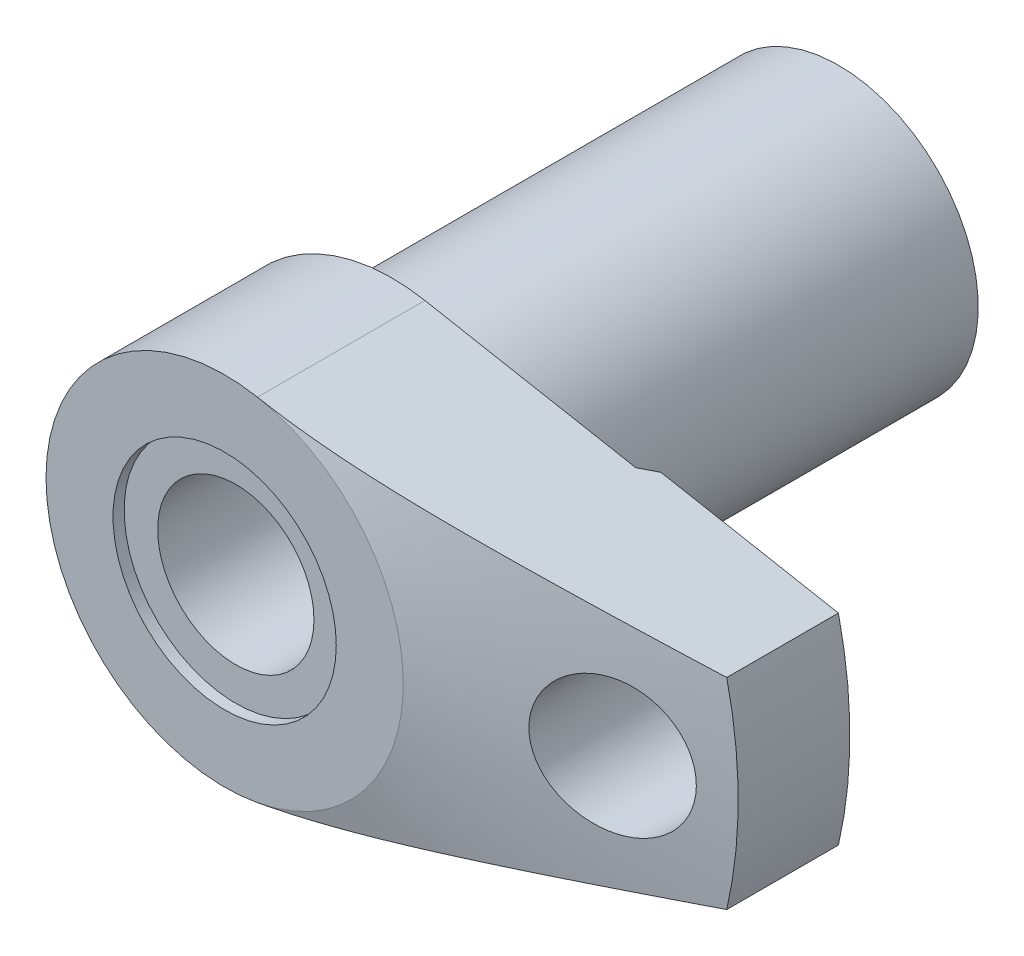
ISO-10303-21;
HEADER;
FILE_DESCRIPTION(('STEP AP214'),'2;1');
FILE_NAME('part.step','',(''),(''),'','','');
FILE_SCHEMA(('AUTOMOTIVE_DESIGN { 1 0 10303 214 1 1 1 1 }'));
ENDSEC;
DATA;
#1=APPLICATION_CONTEXT('core data for automotive mechanical design processes');
#2=APPLICATION_PROTOCOL_DEFINITION('international standard','automotive_design',2000,#1);
#3=PRODUCT_CONTEXT('',#1,'mechanical');
#4=PRODUCT('Part','Part','',(#3));
#5=PRODUCT_RELATED_PRODUCT_CATEGORY('part','',(#4));
#6=PRODUCT_DEFINITION_FORMATION('','',#4);
#7=PRODUCT_DEFINITION_CONTEXT('part definition',#1,'design');
#8=PRODUCT_DEFINITION('design','',#6,#7);
#9=PRODUCT_DEFINITION_SHAPE('','',#8);
#10=(LENGTH_UNIT() NAMED_UNIT(*) SI_UNIT(.MILLI.,.METRE.));
#11=(NAMED_UNIT(*) PLANE_ANGLE_UNIT() SI_UNIT($,.RADIAN.));
#12=(NAMED_UNIT(*) SI_UNIT($,.STERADIAN.) SOLID_ANGLE_UNIT());
#13=UNCERTAINTY_MEASURE_WITH_UNIT(LENGTH_MEASURE(1.E-05),#10,'distance_accuracy_value','');
#14=(GEOMETRIC_REPRESENTATION_CONTEXT(3) GLOBAL_UNCERTAINTY_ASSIGNED_CONTEXT((#13)) GLOBAL_UNIT_ASSIGNED_CONTEXT((#10,
#11,#12)) REPRESENTATION_CONTEXT('',''));
#15=CARTESIAN_POINT('',(0.,0.,0.));
#16=DIRECTION('',(0.,0.,1.));
#17=DIRECTION('',(1.,0.,0.));
#18=AXIS2_PLACEMENT_3D('',#15,#16,#17);
#19=CARTESIAN_POINT('',(38.9743505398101,9.,55.));
#20=DIRECTION('',(-0.183527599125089,-0.983014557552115,0.));
#21=DIRECTION('',(0.983014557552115,-0.183527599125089,0.));
#22=AXIS2_PLACEMENT_3D('',#19,#20,#21);
#23=PLANE('',#22);
#24=DIRECTION('',(0.983014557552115,-0.183527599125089,0.));
#25=VECTOR('',#24,1.);
#26=CARTESIAN_POINT('',(2.93644158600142,15.7282329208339,40.));
#27=LINE('',#26,#25);
#28=CARTESIAN_POINT('',(2.93644158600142,15.7282329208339,40.));
#29=VERTEX_POINT('',#28);
#30=CARTESIAN_POINT('',(21.8195346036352,12.2027828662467,40.));
#31=VERTEX_POINT('',#30);
#32=EDGE_CURVE('E77',#29,#31,#27,.T.);
#33=ORIENTED_EDGE('',*,*,#32,.F.);
#34=DIRECTION('',(0.,0.,-1.));
#35=VECTOR('',#34,1.);
#36=CARTESIAN_POINT('',(2.93644158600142,15.7282329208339,55.));
#37=LINE('',#36,#35);
#38=CARTESIAN_POINT('',(2.93644158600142,15.7282329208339,55.));
#39=VERTEX_POINT('',#38);
#40=EDGE_CURVE('E81',#39,#29,#37,.T.);
#41=ORIENTED_EDGE('',*,*,#40,.F.);
#42=CARTESIAN_POINT('',(2.93624158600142,15.7282702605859,54.9999999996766));
#43=CARTESIAN_POINT('',(3.27198005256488,15.6655883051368,55.0000135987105));
#44=CARTESIAN_POINT('',(3.60771690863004,15.6029066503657,54.9972684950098));
#45=CARTESIAN_POINT('',(4.27909896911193,15.4775604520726,54.9863525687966));
#46=CARTESIAN_POINT('',(4.61474417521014,15.4148959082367,54.9781818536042));
#47=CARTESIAN_POINT('',(5.28578738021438,15.2896129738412,54.9565089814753));
#48=CARTESIAN_POINT('',(5.62118541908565,15.2269945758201,54.9430081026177));
#49=CARTESIAN_POINT('',(6.29174105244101,15.1018026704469,54.910851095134));
#50=CARTESIAN_POINT('',(6.62689864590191,15.0392291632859,54.8921949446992));
#51=CARTESIAN_POINT('',(7.63088618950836,14.8517859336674,54.8288811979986));
#52=CARTESIAN_POINT('',(8.29927611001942,14.7269983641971,54.7768432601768));
#53=CARTESIAN_POINT('',(9.63452756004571,14.4777085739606,54.6552798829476));
#54=CARTESIAN_POINT('',(10.3013889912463,14.3532063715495,54.5857533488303));
#55=CARTESIAN_POINT('',(11.6317544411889,14.1048287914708,54.4318940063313));
#56=CARTESIAN_POINT('',(12.2952626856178,13.9809526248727,54.3475986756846));
#57=CARTESIAN_POINT('',(13.6206011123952,13.7335135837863,54.1664787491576));
#58=CARTESIAN_POINT('',(14.2824313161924,13.6099507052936,54.0696543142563));
#59=CARTESIAN_POINT('',(15.604824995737,13.3630614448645,53.8655820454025));
#60=CARTESIAN_POINT('',(16.2653877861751,13.2397351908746,53.7583296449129));
#61=CARTESIAN_POINT('',(17.5851193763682,12.9933429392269,53.5352726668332));
#62=CARTESIAN_POINT('',(18.244288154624,12.8702769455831,53.4194679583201));
#63=CARTESIAN_POINT('',(19.7431177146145,12.5904473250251,53.1479184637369));
#64=CARTESIAN_POINT('',(20.5823917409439,12.4337559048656,52.9899704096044));
#65=CARTESIAN_POINT('',(22.259269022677,12.1206849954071,52.6651711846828));
#66=CARTESIAN_POINT('',(23.0968722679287,11.9643055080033,52.4983199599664));
#67=CARTESIAN_POINT('',(24.7705715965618,11.6518279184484,52.1576412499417));
#68=CARTESIAN_POINT('',(25.6066678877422,11.4957297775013,51.9838148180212));
#69=CARTESIAN_POINT('',(27.2777257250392,11.1837453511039,51.6306071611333));
#70=CARTESIAN_POINT('',(28.1126872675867,11.0278590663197,51.4512259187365));
#71=CARTESIAN_POINT('',(29.7842993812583,10.7157711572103,51.0874381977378));
#72=CARTESIAN_POINT('',(30.6209469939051,10.5595700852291,50.903017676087));
#73=CARTESIAN_POINT('',(32.2934616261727,10.2473136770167,50.5305455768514));
#74=CARTESIAN_POINT('',(33.1293286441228,10.0912583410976,50.3424939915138));
#75=CARTESIAN_POINT('',(34.8004037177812,9.77927069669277,49.9634277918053));
#76=CARTESIAN_POINT('',(35.6356117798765,9.62333838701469,49.7724132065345));
#77=CARTESIAN_POINT('',(37.3054715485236,9.31157763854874,49.3879134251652));
#78=CARTESIAN_POINT('',(38.1401232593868,9.15574919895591,49.1944282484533));
#79=CARTESIAN_POINT('',(38.9745505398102,8.99996266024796,48.9999533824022));
#80=B_SPLINE_CURVE_WITH_KNOTS('',3,(#42,#43,#44,#45,#46,#47,#48,#49,#50,#51,#52,#53,#54,#55,#56,
#57,#58,#59,#60,#61,#62,#63,#64,#65,#66,#67,#68,#69,#70,#71,#72,#73,#74,#75,#76,#77,#78,#79),
.UNSPECIFIED.,.F.,.F.,(4,2,2,2,2,2,2,2,2,2,2,2,2,2,2,2,2,2,4),(0.,1.02460521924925,
2.04919017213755,3.07352959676,4.09787335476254,6.14337060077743,8.18899591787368,
10.2295034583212,12.2699847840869,14.3113637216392,16.3527739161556,18.9574987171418,
21.5622392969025,24.1665879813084,26.7709448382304,29.383501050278,31.9960628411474,
34.6085989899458,37.2211146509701),.UNSPECIFIED.);
#81=CARTESIAN_POINT('',(38.9743505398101,9.,49.));
#82=VERTEX_POINT('',#81);
#83=EDGE_CURVE('E143',#39,#82,#80,.T.);
#84=ORIENTED_EDGE('',*,*,#83,.T.);
#85=DIRECTION('',(0.,0.,-1.));
#86=VECTOR('',#85,1.);
#87=CARTESIAN_POINT('',(38.9743505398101,9.,55.));
#88=LINE('',#87,#86);
#89=CARTESIAN_POINT('',(38.9743505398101,9.,39.));
#90=VERTEX_POINT('',#89);
#91=EDGE_CURVE('E98',#82,#90,#88,.T.);
#92=ORIENTED_EDGE('',*,*,#91,.T.);
#93=DIRECTION('',(-0.983014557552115,0.183527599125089,0.));
#94=VECTOR('',#93,1.);
#95=CARTESIAN_POINT('',(38.9743505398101,9.,39.));
#96=LINE('',#95,#94);
#97=CARTESIAN_POINT('',(23.0822451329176,11.9670363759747,39.));
#98=VERTEX_POINT('',#97);
#99=EDGE_CURVE('E322',#90,#98,#96,.T.);
#100=ORIENTED_EDGE('',*,*,#99,.T.);
#101=CARTESIAN_POINT('',(-12.1892639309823,18.5521833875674,42.8017644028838));
#102=CARTESIAN_POINT('',(-11.9716131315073,18.5115482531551,42.9552352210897));
#103=CARTESIAN_POINT('',(-11.7531749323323,18.4707661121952,43.1075492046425));
#104=CARTESIAN_POINT('',(-11.3145923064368,18.3888832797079,43.4096307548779));
#105=CARTESIAN_POINT('',(-11.0944478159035,18.3477825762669,43.5593982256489));
#106=CARTESIAN_POINT('',(-10.4310764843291,18.2239319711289,44.0046527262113));
#107=CARTESIAN_POINT('',(-9.98511427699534,18.1406713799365,44.2959484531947));
#108=CARTESIAN_POINT('',(-9.07888967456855,17.9714803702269,44.8687270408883));
#109=CARTESIAN_POINT('',(-8.61851605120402,17.8855291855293,45.1500284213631));
#110=CARTESIAN_POINT('',(-7.68806849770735,17.7118157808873,45.6954613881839));
#111=CARTESIAN_POINT('',(-7.21799577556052,17.6240537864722,45.9595950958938));
#112=CARTESIAN_POINT('',(-6.25356224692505,17.4439952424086,46.4737867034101));
#113=CARTESIAN_POINT('',(-5.75888985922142,17.3516405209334,46.7232441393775));
#114=CARTESIAN_POINT('',(-4.75666121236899,17.1645256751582,47.1943149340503));
#115=CARTESIAN_POINT('',(-4.24910261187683,17.0697651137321,47.4159231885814));
#116=CARTESIAN_POINT('',(-3.223281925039,16.8782456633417,47.8234099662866));
#117=CARTESIAN_POINT('',(-2.70509080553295,16.7815000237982,48.009471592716));
#118=CARTESIAN_POINT('',(-1.65600675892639,16.5856373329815,48.3395993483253));
#119=CARTESIAN_POINT('',(-1.12512218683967,16.486521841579,48.4836923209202));
#120=CARTESIAN_POINT('',(-0.333478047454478,16.3387228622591,48.6598476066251));
#121=CARTESIAN_POINT('',(-0.0767622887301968,16.2907943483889,48.7110738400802));
#122=CARTESIAN_POINT('',(0.438688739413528,16.1945602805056,48.8015554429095));
#123=CARTESIAN_POINT('',(0.697423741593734,16.1462547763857,48.8408123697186));
#124=CARTESIAN_POINT('',(1.21654205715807,16.0493360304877,48.9067562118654));
#125=CARTESIAN_POINT('',(1.47692596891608,16.000722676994,48.933438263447));
#126=CARTESIAN_POINT('',(1.99867646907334,15.903312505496,48.9737701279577));
#127=CARTESIAN_POINT('',(2.26004306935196,15.8545156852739,48.9874197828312));
#128=CARTESIAN_POINT('',(2.77969423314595,15.7574974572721,49.0013585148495));
#129=CARTESIAN_POINT('',(3.03797431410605,15.7092768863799,49.0018202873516));
#130=CARTESIAN_POINT('',(3.55427147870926,15.6128848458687,48.9898133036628));
#131=CARTESIAN_POINT('',(3.81228852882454,15.5647133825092,48.9773430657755));
#132=CARTESIAN_POINT('',(4.32739660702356,15.4685433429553,48.9396786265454));
#133=CARTESIAN_POINT('',(4.58448772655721,15.4205447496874,48.9144857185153));
#134=CARTESIAN_POINT('',(5.09722679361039,15.3248170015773,48.8517917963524));
#135=CARTESIAN_POINT('',(5.35287455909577,15.2770878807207,48.8142892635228));
#136=CARTESIAN_POINT('',(6.11354932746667,15.1350708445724,48.6847083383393));
#137=CARTESIAN_POINT('',(6.61579008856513,15.0413031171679,48.5752881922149));
#138=CARTESIAN_POINT('',(7.60986358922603,14.8557108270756,48.31579057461));
#139=CARTESIAN_POINT('',(8.10169532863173,14.7638864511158,48.1657092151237));
#140=CARTESIAN_POINT('',(8.83269046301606,14.6274105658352,47.9142591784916));
#141=CARTESIAN_POINT('',(9.07619164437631,14.581949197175,47.8256459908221));
#142=CARTESIAN_POINT('',(9.56027380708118,14.4915716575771,47.6404944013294));
#143=CARTESIAN_POINT('',(9.80085477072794,14.4466554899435,47.5439559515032));
#144=CARTESIAN_POINT('',(10.2790455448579,14.3573778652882,47.3437280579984));
#145=CARTESIAN_POINT('',(10.5166560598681,14.3130162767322,47.2400403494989));
#146=CARTESIAN_POINT('',(10.9890224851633,14.2248260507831,47.0261849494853));
#147=CARTESIAN_POINT('',(11.2237784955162,14.1809973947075,46.9160174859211));
#148=CARTESIAN_POINT('',(11.9748909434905,14.0407656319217,46.5520620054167));
#149=CARTESIAN_POINT('',(12.4859028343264,13.9453603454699,46.2868093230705));
#150=CARTESIAN_POINT('',(13.4958766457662,13.7567994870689,45.7334260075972));
#151=CARTESIAN_POINT('',(13.9948347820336,13.6636446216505,45.4452883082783));
#152=CARTESIAN_POINT('',(14.9826537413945,13.4792200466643,44.8504305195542));
#153=CARTESIAN_POINT('',(15.4715024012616,13.3879526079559,44.5436896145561));
#154=CARTESIAN_POINT('',(16.4398875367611,13.20715630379,43.9155277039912));
#155=CARTESIAN_POINT('',(16.9194249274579,13.1176272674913,43.5941081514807));
#156=CARTESIAN_POINT('',(17.8724548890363,12.9396977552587,42.9379831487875));
#157=CARTESIAN_POINT('',(18.3459149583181,12.8513033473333,42.6032289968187));
#158=CARTESIAN_POINT('',(19.2859224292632,12.6758051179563,41.9238290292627));
#159=CARTESIAN_POINT('',(19.7524696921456,12.5887013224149,41.5791830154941));
#160=CARTESIAN_POINT('',(20.6793255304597,12.4156584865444,40.8819058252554));
#161=CARTESIAN_POINT('',(21.1396376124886,12.3297187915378,40.5292794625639));
#162=CARTESIAN_POINT('',(22.0551055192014,12.1588020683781,39.817186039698));
#163=CARTESIAN_POINT('',(22.5102613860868,12.0738250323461,39.4577190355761));
#164=CARTESIAN_POINT('',(23.4191540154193,11.904135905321,38.7305660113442));
#165=CARTESIAN_POINT('',(23.8728605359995,11.8194294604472,38.3628409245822));
#166=CARTESIAN_POINT('',(24.7763269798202,11.6507533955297,37.6224117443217));
#167=CARTESIAN_POINT('',(25.2260868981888,11.5667837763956,37.2497076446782));
#168=CARTESIAN_POINT('',(26.1222046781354,11.3994796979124,36.4999918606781));
#169=CARTESIAN_POINT('',(26.5685621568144,11.3161453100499,36.1229797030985));
#170=CARTESIAN_POINT('',(27.4582431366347,11.1500429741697,35.36526672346));
#171=CARTESIAN_POINT('',(27.9015666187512,11.0672750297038,34.9845658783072));
#172=CARTESIAN_POINT('',(29.2256635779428,10.8200677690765,33.8392944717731));
#173=CARTESIAN_POINT('',(30.1024586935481,10.6563712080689,33.0699624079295));
#174=CARTESIAN_POINT('',(31.8476403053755,10.3305479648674,31.5215859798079));
#175=CARTESIAN_POINT('',(32.7160271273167,10.1684212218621,30.7425419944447));
#176=CARTESIAN_POINT('',(34.1376419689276,9.90300749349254,29.4559211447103));
#177=CARTESIAN_POINT('',(34.6928404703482,9.79935262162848,28.9505938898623));
#178=CARTESIAN_POINT('',(35.8009983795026,9.5924609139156,27.9370012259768));
#179=CARTESIAN_POINT('',(36.353956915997,9.48922424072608,27.4287348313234));
#180=CARTESIAN_POINT('',(37.4533505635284,9.28396880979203,26.4138531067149));
#181=CARTESIAN_POINT('',(37.9998025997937,9.18194689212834,25.9072567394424));
#182=CARTESIAN_POINT('',(39.0906416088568,8.97828860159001,24.8921704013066));
#183=CARTESIAN_POINT('',(39.6350292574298,8.876652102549,24.383681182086));
#184=CARTESIAN_POINT('',(40.1786023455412,8.77516768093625,23.8742944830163));
#185=B_SPLINE_CURVE_WITH_KNOTS('',3,(#101,#102,#103,#104,#105,#106,#107,#108,#109,#110,#111,
#112,#113,#114,#115,#116,#117,#118,#119,#120,#121,#122,#123,#124,#125,#126,#127,#128,#129,#130,
#131,#132,#133,#134,#135,#136,#137,#138,#139,#140,#141,#142,#143,#144,#145,#146,#147,#148,#149,
#150,#151,#152,#153,#154,#155,#156,#157,#158,#159,#160,#161,#162,#163,#164,#165,#166,#167,#168,
#169,#170,#171,#172,#173,#174,#175,#176,#177,#178,#179,#180,#181,#182,#183,#184),.UNSPECIFIED.,
.F.,.F.,(4,2,2,2,2,2,2,2,2,2,2,2,2,2,2,2,2,2,2,2,2,2,2,2,2,2,2,2,2,2,2,2,2,2,2,2,2,2,2,2,2,4),
(0.,0.808193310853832,1.61641699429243,3.23361712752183,4.87227459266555,6.51072918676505,
8.19501852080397,9.87961610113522,11.5552872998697,13.2298843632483,14.0280401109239,
14.8260919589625,15.6244522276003,16.4228221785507,17.2107326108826,17.9987333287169,
18.7866539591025,19.5746718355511,21.1400909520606,22.7056598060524,23.4947914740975,
24.283927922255,25.0728735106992,25.8617913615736,27.611795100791,29.3623413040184,
31.1148837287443,32.8672530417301,34.6267466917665,36.3862756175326,38.1447700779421,
39.9032501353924,41.6735824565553,43.4439169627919,45.2144478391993,46.9849898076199,
50.518572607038,54.052017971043,56.3255762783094,58.5999472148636,60.8562493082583,
63.1117348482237),.UNSPECIFIED.);
#186=EDGE_CURVE('E29',#31,#98,#185,.T.);
#187=ORIENTED_EDGE('',*,*,#186,.F.);
#188=EDGE_LOOP('',(#33,#41,#84,#92,#100,#187));
#189=FACE_BOUND('',#188,.T.);
#190=ADVANCED_FACE('F14',(#189),#23,.F.);
#191=CARTESIAN_POINT('',(38.9743505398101,-9.,55.));
#192=DIRECTION('',(0.183527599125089,-0.983014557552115,0.));
#193=DIRECTION('',(0.983014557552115,0.183527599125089,0.));
#194=AXIS2_PLACEMENT_3D('',#191,#192,#193);
#195=PLANE('',#194);
#196=DIRECTION('',(0.,0.,-1.));
#197=VECTOR('',#196,1.);
#198=CARTESIAN_POINT('',(2.93644158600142,-15.7282329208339,55.));
#199=LINE('',#198,#197);
#200=CARTESIAN_POINT('',(2.93644158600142,-15.7282329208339,55.));
#201=VERTEX_POINT('',#200);
#202=CARTESIAN_POINT('',(2.93644158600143,-15.7282329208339,40.));
#203=VERTEX_POINT('',#202);
#204=EDGE_CURVE('E99',#201,#203,#199,.T.);
#205=ORIENTED_EDGE('',*,*,#204,.T.);
#206=DIRECTION('',(-0.983014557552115,-0.183527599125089,0.));
#207=VECTOR('',#206,1.);
#208=CARTESIAN_POINT('',(21.8195346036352,-12.2027828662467,40.));
#209=LINE('',#208,#207);
#210=CARTESIAN_POINT('',(21.8195346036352,-12.2027828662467,40.));
#211=VERTEX_POINT('',#210);
#212=EDGE_CURVE('E85',#211,#203,#209,.T.);
#213=ORIENTED_EDGE('',*,*,#212,.F.);
#214=CARTESIAN_POINT('',(-12.1892639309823,-18.5521833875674,42.8017644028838));
#215=CARTESIAN_POINT('',(-11.9716131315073,-18.5115482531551,42.9552352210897));
#216=CARTESIAN_POINT('',(-11.7531749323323,-18.4707661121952,43.1075492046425));
#217=CARTESIAN_POINT('',(-11.3145923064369,-18.3888832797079,43.4096307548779));
#218=CARTESIAN_POINT('',(-11.0944478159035,-18.3477825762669,43.5593982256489));
#219=CARTESIAN_POINT('',(-10.4310764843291,-18.2239319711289,44.0046527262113));
#220=CARTESIAN_POINT('',(-9.98511427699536,-18.1406713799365,44.2959484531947));
#221=CARTESIAN_POINT('',(-9.07888967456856,-17.9714803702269,44.8687270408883));
#222=CARTESIAN_POINT('',(-8.61851605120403,-17.8855291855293,45.1500284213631));
#223=CARTESIAN_POINT('',(-7.68806849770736,-17.7118157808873,45.6954613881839));
#224=CARTESIAN_POINT('',(-7.21799577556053,-17.6240537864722,45.9595950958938));
#225=CARTESIAN_POINT('',(-6.25356224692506,-17.4439952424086,46.4737867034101));
#226=CARTESIAN_POINT('',(-5.75888985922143,-17.3516405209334,46.7232441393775));
#227=CARTESIAN_POINT('',(-4.756661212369,-17.1645256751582,47.1943149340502));
#228=CARTESIAN_POINT('',(-4.24910261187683,-17.0697651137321,47.4159231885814));
#229=CARTESIAN_POINT('',(-3.22328192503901,-16.8782456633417,47.8234099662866));
#230=CARTESIAN_POINT('',(-2.70509080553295,-16.7815000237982,48.009471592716));
#231=CARTESIAN_POINT('',(-1.6560067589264,-16.5856373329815,48.3395993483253));
#232=CARTESIAN_POINT('',(-1.12512218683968,-16.486521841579,48.4836923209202));
#233=CARTESIAN_POINT('',(-0.333478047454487,-16.3387228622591,48.6598476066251));
#234=CARTESIAN_POINT('',(-0.0767622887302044,-16.2907943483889,48.7110738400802));
#235=CARTESIAN_POINT('',(0.438688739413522,-16.1945602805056,48.8015554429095));
#236=CARTESIAN_POINT('',(0.697423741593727,-16.1462547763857,48.8408123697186));
#237=CARTESIAN_POINT('',(1.21654205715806,-16.0493360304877,48.9067562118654));
#238=CARTESIAN_POINT('',(1.47692596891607,-16.000722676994,48.933438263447));
#239=CARTESIAN_POINT('',(1.99867646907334,-15.903312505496,48.9737701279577));
#240=CARTESIAN_POINT('',(2.26004306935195,-15.8545156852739,48.9874197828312));
#241=CARTESIAN_POINT('',(2.77969423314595,-15.7574974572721,49.0013585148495));
#242=CARTESIAN_POINT('',(3.03797431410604,-15.7092768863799,49.0018202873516));
#243=CARTESIAN_POINT('',(3.55427147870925,-15.6128848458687,48.9898133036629));
#244=CARTESIAN_POINT('',(3.81228852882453,-15.5647133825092,48.9773430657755));
#245=CARTESIAN_POINT('',(4.32739660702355,-15.4685433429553,48.9396786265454));
#246=CARTESIAN_POINT('',(4.5844877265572,-15.4205447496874,48.9144857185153));
#247=CARTESIAN_POINT('',(5.09722679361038,-15.3248170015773,48.8517917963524));
#248=CARTESIAN_POINT('',(5.35287455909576,-15.2770878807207,48.8142892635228));
#249=CARTESIAN_POINT('',(6.11354932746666,-15.1350708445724,48.6847083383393));
#250=CARTESIAN_POINT('',(6.61579008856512,-15.0413031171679,48.5752881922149));
#251=CARTESIAN_POINT('',(7.60986358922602,-14.8557108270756,48.31579057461));
#252=CARTESIAN_POINT('',(8.10169532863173,-14.7638864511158,48.1657092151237));
#253=CARTESIAN_POINT('',(8.83269046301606,-14.6274105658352,47.9142591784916));
#254=CARTESIAN_POINT('',(9.07619164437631,-14.581949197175,47.8256459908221));
#255=CARTESIAN_POINT('',(9.56027380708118,-14.4915716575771,47.6404944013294));
#256=CARTESIAN_POINT('',(9.80085477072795,-14.4466554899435,47.5439559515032));
#257=CARTESIAN_POINT('',(10.2790455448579,-14.3573778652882,47.3437280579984));
#258=CARTESIAN_POINT('',(10.5166560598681,-14.3130162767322,47.2400403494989));
#259=CARTESIAN_POINT('',(10.9890224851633,-14.2248260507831,47.0261849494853));
#260=CARTESIAN_POINT('',(11.2237784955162,-14.1809973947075,46.9160174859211));
#261=CARTESIAN_POINT('',(11.9748909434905,-14.0407656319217,46.5520620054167));
#262=CARTESIAN_POINT('',(12.4859028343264,-13.9453603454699,46.2868093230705));
#263=CARTESIAN_POINT('',(13.4958766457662,-13.7567994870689,45.7334260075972));
#264=CARTESIAN_POINT('',(13.9948347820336,-13.6636446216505,45.4452883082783));
#265=CARTESIAN_POINT('',(14.9826537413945,-13.4792200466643,44.8504305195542));
#266=CARTESIAN_POINT('',(15.4715024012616,-13.3879526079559,44.5436896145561));
#267=CARTESIAN_POINT('',(16.4398875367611,-13.20715630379,43.9155277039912));
#268=CARTESIAN_POINT('',(16.9194249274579,-13.1176272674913,43.5941081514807));
#269=CARTESIAN_POINT('',(17.8724548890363,-12.9396977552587,42.9379831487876));
#270=CARTESIAN_POINT('',(18.3459149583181,-12.8513033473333,42.6032289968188));
#271=CARTESIAN_POINT('',(19.2859224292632,-12.6758051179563,41.9238290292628));
#272=CARTESIAN_POINT('',(19.7524696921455,-12.5887013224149,41.5791830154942));
#273=CARTESIAN_POINT('',(20.6793255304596,-12.4156584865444,40.8819058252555));
#274=CARTESIAN_POINT('',(21.1396376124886,-12.3297187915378,40.5292794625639));
#275=CARTESIAN_POINT('',(22.0551055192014,-12.1588020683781,39.817186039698));
#276=CARTESIAN_POINT('',(22.5102613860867,-12.0738250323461,39.4577190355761));
#277=CARTESIAN_POINT('',(23.4191540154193,-11.9041359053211,38.7305660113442));
#278=CARTESIAN_POINT('',(23.8728605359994,-11.8194294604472,38.3628409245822));
#279=CARTESIAN_POINT('',(24.7763269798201,-11.6507533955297,37.6224117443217));
#280=CARTESIAN_POINT('',(25.2260868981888,-11.5667837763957,37.2497076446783));
#281=CARTESIAN_POINT('',(26.1222046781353,-11.3994796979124,36.4999918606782));
#282=CARTESIAN_POINT('',(26.5685621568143,-11.3161453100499,36.1229797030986));
#283=CARTESIAN_POINT('',(27.4582431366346,-11.1500429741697,35.3652667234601));
#284=CARTESIAN_POINT('',(27.9015666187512,-11.0672750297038,34.9845658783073));
#285=CARTESIAN_POINT('',(29.2256635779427,-10.8200677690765,33.8392944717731));
#286=CARTESIAN_POINT('',(30.102458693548,-10.6563712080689,33.0699624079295));
#287=CARTESIAN_POINT('',(31.8476403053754,-10.3305479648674,31.521585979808));
#288=CARTESIAN_POINT('',(32.7160271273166,-10.1684212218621,30.7425419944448));
#289=CARTESIAN_POINT('',(34.1376419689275,-9.90300749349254,29.4559211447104));
#290=CARTESIAN_POINT('',(34.6928404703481,-9.79935262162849,28.9505938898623));
#291=CARTESIAN_POINT('',(35.8009983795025,-9.59246091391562,27.9370012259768));
#292=CARTESIAN_POINT('',(36.353956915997,-9.48922424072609,27.4287348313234));
#293=CARTESIAN_POINT('',(37.4533505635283,-9.28396880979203,26.4138531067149));
#294=CARTESIAN_POINT('',(37.9998025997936,-9.18194689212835,25.9072567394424));
#295=CARTESIAN_POINT('',(39.0906416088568,-8.97828860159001,24.8921704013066));
#296=CARTESIAN_POINT('',(39.6350292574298,-8.876652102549,24.3836811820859));
#297=CARTESIAN_POINT('',(40.1786023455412,-8.77516768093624,23.8742944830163));
#298=B_SPLINE_CURVE_WITH_KNOTS('',3,(#214,#215,#216,#217,#218,#219,#220,#221,#222,#223,#224,
#225,#226,#227,#228,#229,#230,#231,#232,#233,#234,#235,#236,#237,#238,#239,#240,#241,#242,#243,
#244,#245,#246,#247,#248,#249,#250,#251,#252,#253,#254,#255,#256,#257,#258,#259,#260,#261,#262,
#263,#264,#265,#266,#267,#268,#269,#270,#271,#272,#273,#274,#275,#276,#277,#278,#279,#280,#281,
#282,#283,#284,#285,#286,#287,#288,#289,#290,#291,#292,#293,#294,#295,#296,#297),.UNSPECIFIED.,
.F.,.F.,(4,2,2,2,2,2,2,2,2,2,2,2,2,2,2,2,2,2,2,2,2,2,2,2,2,2,2,2,2,2,2,2,2,2,2,2,2,2,2,2,2,4),
(0.,0.808193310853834,1.61641699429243,3.23361712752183,4.87227459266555,6.51072918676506,
8.19501852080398,9.87961610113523,11.5552872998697,13.2298843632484,14.0280401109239,
14.8260919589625,15.6244522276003,16.4228221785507,17.2107326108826,17.9987333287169,
18.7866539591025,19.5746718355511,21.1400909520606,22.7056598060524,23.4947914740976,
24.2839279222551,25.0728735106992,25.8617913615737,27.6117951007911,29.3623413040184,
31.1148837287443,32.8672530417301,34.6267466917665,36.3862756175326,38.144770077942,
39.9032501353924,41.6735824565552,43.4439169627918,45.2144478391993,46.9849898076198,
50.5185726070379,54.0520179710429,56.3255762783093,58.5999472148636,60.8562493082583,
63.1117348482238),.UNSPECIFIED.);
#299=CARTESIAN_POINT('',(23.0822451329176,-11.9670363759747,39.));
#300=VERTEX_POINT('',#299);
#301=EDGE_CURVE('E159',#211,#300,#298,.T.);
#302=ORIENTED_EDGE('',*,*,#301,.T.);
#303=DIRECTION('',(-0.983014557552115,-0.183527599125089,0.));
#304=VECTOR('',#303,1.);
#305=CARTESIAN_POINT('',(38.9743505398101,-9.,39.));
#306=LINE('',#305,#304);
#307=CARTESIAN_POINT('',(38.9743505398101,-9.,39.));
#308=VERTEX_POINT('',#307);
#309=EDGE_CURVE('E108',#308,#300,#306,.T.);
#310=ORIENTED_EDGE('',*,*,#309,.F.);
#311=DIRECTION('',(0.,0.,-1.));
#312=VECTOR('',#311,1.);
#313=CARTESIAN_POINT('',(38.9743505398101,-9.,55.));
#314=LINE('',#313,#312);
#315=CARTESIAN_POINT('',(38.9743505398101,-9.,49.));
#316=VERTEX_POINT('',#315);
#317=EDGE_CURVE('E37',#316,#308,#314,.T.);
#318=ORIENTED_EDGE('',*,*,#317,.F.);
#319=CARTESIAN_POINT('',(2.93624158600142,-15.7282702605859,54.9999999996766));
#320=CARTESIAN_POINT('',(3.27198005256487,-15.6655883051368,55.0000135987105));
#321=CARTESIAN_POINT('',(3.60771690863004,-15.6029066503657,54.9972684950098));
#322=CARTESIAN_POINT('',(4.27909896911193,-15.4775604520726,54.9863525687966));
#323=CARTESIAN_POINT('',(4.61474417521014,-15.4148959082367,54.9781818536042));
#324=CARTESIAN_POINT('',(5.28578738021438,-15.2896129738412,54.9565089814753));
#325=CARTESIAN_POINT('',(5.62118541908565,-15.2269945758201,54.9430081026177));
#326=CARTESIAN_POINT('',(6.29174105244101,-15.1018026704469,54.910851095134));
#327=CARTESIAN_POINT('',(6.62689864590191,-15.0392291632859,54.8921949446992));
#328=CARTESIAN_POINT('',(7.63088618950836,-14.8517859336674,54.8288811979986));
#329=CARTESIAN_POINT('',(8.29927611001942,-14.7269983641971,54.7768432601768));
#330=CARTESIAN_POINT('',(9.63452756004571,-14.4777085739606,54.6552798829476));
#331=CARTESIAN_POINT('',(10.3013889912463,-14.3532063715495,54.5857533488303));
#332=CARTESIAN_POINT('',(11.6317544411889,-14.1048287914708,54.4318940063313));
#333=CARTESIAN_POINT('',(12.2952626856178,-13.9809526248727,54.3475986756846));
#334=CARTESIAN_POINT('',(13.6206011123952,-13.7335135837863,54.1664787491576));
#335=CARTESIAN_POINT('',(14.2824313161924,-13.6099507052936,54.0696543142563));
#336=CARTESIAN_POINT('',(15.604824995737,-13.3630614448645,53.8655820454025));
#337=CARTESIAN_POINT('',(16.2653877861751,-13.2397351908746,53.7583296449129));
#338=CARTESIAN_POINT('',(17.5851193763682,-12.9933429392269,53.5352726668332));
#339=CARTESIAN_POINT('',(18.244288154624,-12.8702769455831,53.4194679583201));
#340=CARTESIAN_POINT('',(19.7431177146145,-12.5904473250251,53.1479184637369));
#341=CARTESIAN_POINT('',(20.5823917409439,-12.4337559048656,52.9899704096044));
#342=CARTESIAN_POINT('',(22.259269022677,-12.1206849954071,52.6651711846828));
#343=CARTESIAN_POINT('',(23.0968722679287,-11.9643055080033,52.4983199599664));
#344=CARTESIAN_POINT('',(24.7705715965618,-11.6518279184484,52.1576412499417));
#345=CARTESIAN_POINT('',(25.6066678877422,-11.4957297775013,51.9838148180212));
#346=CARTESIAN_POINT('',(27.2777257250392,-11.1837453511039,51.6306071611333));
#347=CARTESIAN_POINT('',(28.1126872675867,-11.0278590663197,51.4512259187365));
#348=CARTESIAN_POINT('',(29.7842993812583,-10.7157711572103,51.0874381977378));
#349=CARTESIAN_POINT('',(30.6209469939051,-10.5595700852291,50.903017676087));
#350=CARTESIAN_POINT('',(32.2934616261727,-10.2473136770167,50.5305455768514));
#351=CARTESIAN_POINT('',(33.1293286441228,-10.0912583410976,50.3424939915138));
#352=CARTESIAN_POINT('',(34.8004037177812,-9.77927069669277,49.9634277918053));
#353=CARTESIAN_POINT('',(35.6356117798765,-9.62333838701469,49.7724132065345));
#354=CARTESIAN_POINT('',(37.3054715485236,-9.31157763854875,49.3879134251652));
#355=CARTESIAN_POINT('',(38.1401232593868,-9.15574919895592,49.1944282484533));
#356=CARTESIAN_POINT('',(38.9745505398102,-8.99996266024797,48.9999533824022));
#357=B_SPLINE_CURVE_WITH_KNOTS('',3,(#319,#320,#321,#322,#323,#324,#325,#326,#327,#328,#329,
#330,#331,#332,#333,#334,#335,#336,#337,#338,#339,#340,#341,#342,#343,#344,#345,#346,#347,#348,
#349,#350,#351,#352,#353,#354,#355,#356),.UNSPECIFIED.,.F.,.F.,(4,2,2,2,2,2,2,2,2,2,2,2,2,2,2,2,
2,2,4),(0.,1.02460521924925,2.04919017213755,3.07352959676,4.09787335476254,6.14337060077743,
8.18899591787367,10.2295034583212,12.2699847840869,14.3113637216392,16.3527739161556,
18.9574987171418,21.5622392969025,24.1665879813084,26.7709448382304,29.383501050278,
31.9960628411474,34.6085989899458,37.22111465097),.UNSPECIFIED.);
#358=EDGE_CURVE('E117',#201,#316,#357,.T.);
#359=ORIENTED_EDGE('',*,*,#358,.F.);
#360=EDGE_LOOP('',(#205,#213,#302,#310,#318,#359));
#361=FACE_BOUND('',#360,.T.);
#362=ADVANCED_FACE('F150',(#361),#195,.T.);
#363=CARTESIAN_POINT('',(31.,0.,55.));
#364=DIRECTION('',(0.,0.,-1.));
#365=DIRECTION('',(-1.,0.,0.));
#366=AXIS2_PLACEMENT_3D('',#363,#364,#365);
#367=CYLINDRICAL_SURFACE('',#366,6.);
#368=CARTESIAN_POINT('',(27.0036979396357,-4.47544074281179,52.1569868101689));
#369=CARTESIAN_POINT('',(26.8803036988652,-4.36525983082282,52.1919238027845));
#370=CARTESIAN_POINT('',(26.7613386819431,-4.24985471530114,52.2258753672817));
#371=CARTESIAN_POINT('',(26.5330387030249,-4.00920908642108,52.2914904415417));
#372=CARTESIAN_POINT('',(26.4237055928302,-3.88396669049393,52.323153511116));
#373=CARTESIAN_POINT('',(26.2154783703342,-3.62437021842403,52.383853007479));
#374=CARTESIAN_POINT('',(26.1165902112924,-3.49001101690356,52.4128879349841));
#375=CARTESIAN_POINT('',(25.9300663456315,-3.21304457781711,52.4679814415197));
#376=CARTESIAN_POINT('',(25.8424345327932,-3.07043451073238,52.4940389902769));
#377=CARTESIAN_POINT('',(25.6790928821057,-2.77777994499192,52.5428657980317));
#378=CARTESIAN_POINT('',(25.6033969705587,-2.62772702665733,52.5656312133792));
#379=CARTESIAN_POINT('',(25.4647044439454,-2.32137322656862,52.6075302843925));
#380=CARTESIAN_POINT('',(25.4017076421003,-2.1650724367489,52.6266639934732));
#381=CARTESIAN_POINT('',(25.2889960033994,-1.84738516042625,52.6610209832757));
#382=CARTESIAN_POINT('',(25.2392772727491,-1.68600018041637,52.6762454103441));
#383=CARTESIAN_POINT('',(25.1535616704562,-1.35929327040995,52.7025620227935));
#384=CARTESIAN_POINT('',(25.1175647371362,-1.19397135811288,52.7136542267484));
#385=CARTESIAN_POINT('',(25.0604630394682,-0.865396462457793,52.7312784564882));
#386=CARTESIAN_POINT('',(25.0389637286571,-0.702218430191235,52.7379312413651));
#387=CARTESIAN_POINT('',(25.0094366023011,-0.374473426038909,52.7470736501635));
#388=CARTESIAN_POINT('',(25.001413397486,-0.209905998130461,52.7495618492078));
#389=CARTESIAN_POINT('',(24.9989289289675,0.119265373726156,52.7503320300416));
#390=CARTESIAN_POINT('',(25.004461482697,0.283869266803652,52.7486159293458));
#391=CARTESIAN_POINT('',(25.0290284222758,0.61203036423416,52.7410065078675));
#392=CARTESIAN_POINT('',(25.0480677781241,0.775587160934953,52.7351116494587));
#393=CARTESIAN_POINT('',(25.098954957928,1.09709567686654,52.719394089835));
#394=CARTESIAN_POINT('',(25.1305354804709,1.25509382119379,52.7096533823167));
#395=CARTESIAN_POINT('',(25.2062281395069,1.56783323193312,52.6863822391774));
#396=CARTESIAN_POINT('',(25.2503447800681,1.7225733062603,52.6728504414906));
#397=CARTESIAN_POINT('',(25.3507120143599,2.02763919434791,52.6421903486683));
#398=CARTESIAN_POINT('',(25.4069584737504,2.17796649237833,52.625063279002));
#399=CARTESIAN_POINT('',(25.5311504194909,2.47333065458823,52.5874293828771));
#400=CARTESIAN_POINT('',(25.599100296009,2.61836550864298,52.5669212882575));
#401=CARTESIAN_POINT('',(25.7472684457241,2.9043282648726,52.5224490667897));
#402=CARTESIAN_POINT('',(25.8276569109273,3.04516072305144,52.4984373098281));
#403=CARTESIAN_POINT('',(25.9992921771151,3.31951013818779,52.4474884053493));
#404=CARTESIAN_POINT('',(26.0905429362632,3.45302440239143,52.4205501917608));
#405=CARTESIAN_POINT('',(26.3795515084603,3.84126749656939,52.3358093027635));
#406=CARTESIAN_POINT('',(26.5926947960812,4.08394461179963,52.274041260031));
#407=CARTESIAN_POINT('',(27.0623846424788,4.53942241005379,52.1400516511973));
#408=CARTESIAN_POINT('',(27.3202693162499,4.75074344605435,52.0675227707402));
#409=CARTESIAN_POINT('',(27.866233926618,5.12732630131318,51.9165791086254));
#410=CARTESIAN_POINT('',(28.1543194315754,5.29257960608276,51.8381632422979));
#411=CARTESIAN_POINT('',(28.7635441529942,5.57811606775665,51.6751721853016));
#412=CARTESIAN_POINT('',(29.0854899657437,5.69661127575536,51.5904773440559));
#413=CARTESIAN_POINT('',(29.7446039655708,5.87713900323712,51.4200854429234));
#414=CARTESIAN_POINT('',(30.0817738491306,5.93916521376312,51.3343882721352));
#415=CARTESIAN_POINT('',(30.7677203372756,6.00555610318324,51.1629157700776));
#416=CARTESIAN_POINT('',(31.1165966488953,6.0089536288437,51.0771624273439));
#417=CARTESIAN_POINT('',(31.8105444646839,5.95517648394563,50.9092388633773));
#418=CARTESIAN_POINT('',(32.1556159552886,5.89800159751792,50.8270686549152));
#419=CARTESIAN_POINT('',(32.8303045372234,5.72457476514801,50.6686626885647));
#420=CARTESIAN_POINT('',(33.1599837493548,5.60858772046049,50.5924020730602));
#421=CARTESIAN_POINT('',(33.7955452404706,5.32039816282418,50.4471925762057));
#422=CARTESIAN_POINT('',(34.1014296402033,5.14820066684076,50.3782430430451));
#423=CARTESIAN_POINT('',(34.6743085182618,4.75580941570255,50.2504595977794));
#424=CARTESIAN_POINT('',(34.9419278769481,4.53658255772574,50.1914593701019));
#425=CARTESIAN_POINT('',(35.4365116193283,4.05421202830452,50.0833352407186));
#426=CARTESIAN_POINT('',(35.6634814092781,3.7910742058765,50.0342100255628));
#427=CARTESIAN_POINT('',(36.0644568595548,3.23511142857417,49.947978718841));
#428=CARTESIAN_POINT('',(36.239597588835,2.9431451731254,49.9106136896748));
#429=CARTESIAN_POINT('',(36.5383535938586,2.33281619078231,49.8471517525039));
#430=CARTESIAN_POINT('',(36.6619752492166,2.01445673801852,49.8210534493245));
#431=CARTESIAN_POINT('',(36.8516428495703,1.36735419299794,49.7811059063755));
#432=CARTESIAN_POINT('',(36.9188068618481,1.038953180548,49.7670187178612));
#433=CARTESIAN_POINT('',(36.9975669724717,0.375272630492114,49.7505058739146));
#434=CARTESIAN_POINT('',(37.0091673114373,0.0399936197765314,49.7480793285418));
#435=CARTESIAN_POINT('',(36.9766103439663,-0.624071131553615,49.7548999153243));
#436=CARTESIAN_POINT('',(36.9330543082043,-0.952887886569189,49.7640211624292));
#437=CARTESIAN_POINT('',(36.7925991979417,-1.59839607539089,49.7935328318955));
#438=CARTESIAN_POINT('',(36.6957008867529,-1.91508768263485,49.8139230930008));
#439=CARTESIAN_POINT('',(36.4515005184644,-2.52787317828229,49.865574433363));
#440=CARTESIAN_POINT('',(36.304131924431,-2.82393925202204,49.8968498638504));
#441=CARTESIAN_POINT('',(35.96342747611,-3.38711733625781,49.969656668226));
#442=CARTESIAN_POINT('',(35.7700893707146,-3.65422792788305,50.0111885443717));
#443=CARTESIAN_POINT('',(35.4489157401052,-4.0292494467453,50.0807738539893));
#444=CARTESIAN_POINT('',(35.3357832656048,-4.15072052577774,50.1053767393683));
#445=CARTESIAN_POINT('',(35.1001315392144,-4.38364186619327,50.1568573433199));
#446=CARTESIAN_POINT('',(34.9776154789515,-4.49509550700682,50.1837342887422));
#447=CARTESIAN_POINT('',(34.7240427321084,-4.70732052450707,50.2396377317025));
#448=CARTESIAN_POINT('',(34.592982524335,-4.80808745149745,50.2686651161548));
#449=CARTESIAN_POINT('',(34.3233546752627,-4.99825130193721,50.3287025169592));
#450=CARTESIAN_POINT('',(34.1847895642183,-5.08765202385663,50.3597118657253));
#451=CARTESIAN_POINT('',(33.8980583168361,-5.25637881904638,50.4242470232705));
#452=CARTESIAN_POINT('',(33.7497502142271,-5.33544849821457,50.4578124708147));
#453=CARTESIAN_POINT('',(33.4474113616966,-5.48072048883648,50.5266651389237));
#454=CARTESIAN_POINT('',(33.2933825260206,-5.54692705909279,50.5619517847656));
#455=CARTESIAN_POINT('',(32.9805851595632,-5.6661545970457,50.6340829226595));
#456=CARTESIAN_POINT('',(32.8218147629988,-5.71917029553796,50.6709280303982));
#457=CARTESIAN_POINT('',(32.5007543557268,-5.8116811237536,50.7459507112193));
#458=CARTESIAN_POINT('',(32.3384655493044,-5.85118080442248,50.7841278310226));
#459=CARTESIAN_POINT('',(32.0075616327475,-5.91725885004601,50.8625327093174));
#460=CARTESIAN_POINT('',(31.83888760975,-5.94351027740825,50.9027875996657));
#461=CARTESIAN_POINT('',(31.5002043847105,-5.98154035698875,50.9842374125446));
#462=CARTESIAN_POINT('',(31.3301956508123,-5.99332387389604,51.0254320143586));
#463=CARTESIAN_POINT('',(30.9898498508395,-6.00240748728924,51.1085554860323));
#464=CARTESIAN_POINT('',(30.8195126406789,-5.99969781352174,51.150484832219));
#465=CARTESIAN_POINT('',(30.4798556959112,-5.97983119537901,51.2347751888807));
#466=CARTESIAN_POINT('',(30.3105356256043,-5.96267931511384,51.277136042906));
#467=CARTESIAN_POINT('',(29.9708748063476,-5.91361892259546,51.3628206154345));
#468=CARTESIAN_POINT('',(29.8005735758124,-5.88144207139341,51.4061475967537));
#469=CARTESIAN_POINT('',(29.4634216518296,-5.80249039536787,51.4926616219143));
#470=CARTESIAN_POINT('',(29.296569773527,-5.75572067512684,51.5358487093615));
#471=CARTESIAN_POINT('',(28.9675467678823,-5.64792675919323,51.6217490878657));
#472=CARTESIAN_POINT('',(28.8053723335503,-5.58691292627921,51.6644626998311));
#473=CARTESIAN_POINT('',(28.4867849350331,-5.45103148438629,51.7490977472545));
#474=CARTESIAN_POINT('',(28.3303706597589,-5.37616705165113,51.7910193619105));
#475=CARTESIAN_POINT('',(27.9669508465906,-5.18241568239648,51.8892572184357));
#476=CARTESIAN_POINT('',(27.7629657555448,-5.05754746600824,51.9450771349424));
#477=CARTESIAN_POINT('',(27.370783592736,-4.78392610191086,52.0536173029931));
#478=CARTESIAN_POINT('',(27.1825862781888,-4.63517332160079,52.1063376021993));
#479=CARTESIAN_POINT('',(27.0036979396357,-4.47544074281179,52.1569868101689));
#480=B_SPLINE_CURVE_WITH_KNOTS('',3,(#368,#369,#370,#371,#372,#373,#374,#375,#376,#377,#378,
#379,#380,#381,#382,#383,#384,#385,#386,#387,#388,#389,#390,#391,#392,#393,#394,#395,#396,#397,
#398,#399,#400,#401,#402,#403,#404,#405,#406,#407,#408,#409,#410,#411,#412,#413,#414,#415,#416,
#417,#418,#419,#420,#421,#422,#423,#424,#425,#426,#427,#428,#429,#430,#431,#432,#433,#434,#435,
#436,#437,#438,#439,#440,#441,#442,#443,#444,#445,#446,#447,#448,#449,#450,#451,#452,#453,#454,
#455,#456,#457,#458,#459,#460,#461,#462,#463,#464,#465,#466,#467,#468,#469,#470,#471,#472,#473,
#474,#475,#476,#477,#478,#479),.UNSPECIFIED.,.T.,.F.,(4,2,2,2,2,2,2,2,2,2,2,2,2,2,2,2,2,2,2,2,2,
2,2,2,2,2,2,2,2,2,2,2,2,2,2,2,2,2,2,2,2,2,2,2,2,2,2,2,2,2,2,2,2,2,2,4),(0.,0.507028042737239,
1.0141533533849,1.5215661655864,2.0291540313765,2.53732981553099,3.04549812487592,
3.55351724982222,4.0615340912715,4.5550978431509,5.04883042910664,5.54233787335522,
6.03602700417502,6.51971447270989,7.0035759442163,7.48727275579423,7.97115140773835,
8.46235711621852,8.95374236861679,9.93567587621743,10.9547991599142,11.9741106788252,
13.0293063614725,14.0846199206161,15.1573258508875,16.2300356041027,17.297956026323,
18.3657811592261,19.4134585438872,20.4609964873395,21.4835262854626,22.5059294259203,
23.5075734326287,24.5091409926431,25.4998836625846,26.4906121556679,27.4826518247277,
28.4747400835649,28.9776876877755,29.4804649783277,29.983450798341,30.4862680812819,
30.9998403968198,31.5132423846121,32.0268491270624,32.5402827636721,33.0658332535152,
33.5912069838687,34.1169349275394,34.6424786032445,35.1777899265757,35.7129142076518,
36.2476503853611,36.7822640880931,37.51732918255,38.2523829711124),.UNSPECIFIED.);
#481=CARTESIAN_POINT('',(27.0036979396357,-4.47544074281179,52.1569868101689));
#482=VERTEX_POINT('',#481);
#483=EDGE_CURVE('E110',#482,#482,#480,.T.);
#484=ORIENTED_EDGE('',*,*,#483,.F.);
#485=EDGE_LOOP('',(#484));
#486=FACE_BOUND('',#485,.T.);
#487=CARTESIAN_POINT('',(31.,0.,39.));
#488=DIRECTION('',(0.,0.,1.));
#489=DIRECTION('',(1.,0.,0.));
#490=AXIS2_PLACEMENT_3D('',#487,#488,#489);
#491=CIRCLE('',#490,6.);
#492=CARTESIAN_POINT('',(25.8225806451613,-3.03221516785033,39.));
#493=VERTEX_POINT('',#492);
#494=CARTESIAN_POINT('',(25.8225806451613,3.03221516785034,39.));
#495=VERTEX_POINT('',#494);
#496=EDGE_CURVE('E105',#493,#495,#491,.T.);
#497=ORIENTED_EDGE('',*,*,#496,.F.);
#498=CARTESIAN_POINT('',(25.8227483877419,-3.03250156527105,38.9998));
#499=CARTESIAN_POINT('',(25.7667244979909,-2.93682415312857,39.0665956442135));
#500=CARTESIAN_POINT('',(25.7127048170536,-2.83854072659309,39.1312624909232));
#501=CARTESIAN_POINT('',(25.6090745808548,-2.63645745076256,39.2557483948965));
#502=CARTESIAN_POINT('',(25.5594716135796,-2.53264857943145,39.3155590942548));
#503=CARTESIAN_POINT('',(25.4172328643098,-2.21086272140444,39.4876178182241));
#504=CARTESIAN_POINT('',(25.3322993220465,-1.98441818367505,39.5911382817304));
#505=CARTESIAN_POINT('',(25.2241437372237,-1.6294228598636,39.7235503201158));
#506=CARTESIAN_POINT('',(25.1912001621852,-1.5079827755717,39.7639996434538));
#507=CARTESIAN_POINT('',(25.1325947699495,-1.26081393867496,39.8360938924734));
#508=CARTESIAN_POINT('',(25.1069294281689,-1.13508729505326,39.8677430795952));
#509=CARTESIAN_POINT('',(25.0636146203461,-0.880842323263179,39.921227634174));
#510=CARTESIAN_POINT('',(25.0459276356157,-0.752340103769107,39.94310893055));
#511=CARTESIAN_POINT('',(25.0188815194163,-0.493139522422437,39.9765921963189));
#512=CARTESIAN_POINT('',(25.0095207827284,-0.362441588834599,39.9881961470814));
#513=CARTESIAN_POINT('',(25.0000272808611,-0.11643532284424,39.9999656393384));
#514=CARTESIAN_POINT('',(24.9988965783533,-0.00122239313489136,40.0013681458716));
#515=CARTESIAN_POINT('',(25.0032631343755,0.228881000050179,39.9959538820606));
#516=CARTESIAN_POINT('',(25.0087600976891,0.343771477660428,39.9891374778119));
#517=CARTESIAN_POINT('',(25.0262657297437,0.572412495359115,39.9674493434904));
#518=CARTESIAN_POINT('',(25.0382814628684,0.68616166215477,39.952568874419));
#519=CARTESIAN_POINT('',(25.0685513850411,0.911516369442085,39.9151334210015));
#520=CARTESIAN_POINT('',(25.0868055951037,1.02312190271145,39.8925784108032));
#521=CARTESIAN_POINT('',(25.1477237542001,1.33976035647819,39.8174406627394));
#522=CARTESIAN_POINT('',(25.1977861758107,1.54130890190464,39.7558325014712));
#523=CARTESIAN_POINT('',(25.3156120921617,1.93115144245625,39.6115556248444));
#524=CARTESIAN_POINT('',(25.3833881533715,2.11943590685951,39.528871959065));
#525=CARTESIAN_POINT('',(25.5124056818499,2.43024959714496,39.3724089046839));
#526=CARTESIAN_POINT('',(25.5701078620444,2.55635858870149,39.3026845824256));
#527=CARTESIAN_POINT('',(25.6918691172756,2.80039995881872,39.1562139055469));
#528=CARTESIAN_POINT('',(25.7559010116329,2.91836389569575,39.0794976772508));
#529=CARTESIAN_POINT('',(25.8227483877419,3.03250156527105,38.9998));
#530=B_SPLINE_CURVE_WITH_KNOTS('',3,(#498,#499,#500,#501,#502,#503,#504,#505,#506,#507,#508,
#509,#510,#511,#512,#513,#514,#515,#516,#517,#518,#519,#520,#521,#522,#523,#524,#525,#526,#527,
#528,#529),.UNSPECIFIED.,.F.,.F.,(4,2,2,2,2,2,2,2,2,2,2,2,2,2,2,4),(0.,0.388151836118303,
0.776958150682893,1.56227190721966,1.95833649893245,2.35420896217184,2.74819989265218,
3.14211484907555,3.48732119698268,3.83251216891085,4.17807797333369,4.52364494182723,
5.17085327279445,5.81852200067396,6.28370724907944,6.74697519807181),.UNSPECIFIED.);
#531=CARTESIAN_POINT('',(25.,0.,40.));
#532=VERTEX_POINT('',#531);
#533=EDGE_CURVE('E168',#493,#532,#530,.T.);
#534=ORIENTED_EDGE('',*,*,#533,.T.);
#535=EDGE_CURVE('E169',#532,#495,#530,.T.);
#536=ORIENTED_EDGE('',*,*,#535,.T.);
#537=EDGE_LOOP('',(#497,#534,#536));
#538=FACE_BOUND('',#537,.T.);
#539=ADVANCED_FACE('F120',(#486,#538),#367,.F.);
#540=CARTESIAN_POINT('',(50.,20.,39.));
#541=DIRECTION('',(0.,0.,1.));
#542=DIRECTION('',(1.,0.,0.));
#543=AXIS2_PLACEMENT_3D('',#540,#541,#542);
#544=PLANE('',#543);
#545=CARTESIAN_POINT('',(0.,0.,39.));
#546=DIRECTION('',(0.,0.,1.));
#547=DIRECTION('',(1.,0.,0.));
#548=AXIS2_PLACEMENT_3D('',#545,#546,#547);
#549=CIRCLE('',#548,26.);
#550=EDGE_CURVE('E9',#493,#300,#549,.F.);
#551=ORIENTED_EDGE('',*,*,#550,.F.);
#552=ORIENTED_EDGE('',*,*,#496,.T.);
#553=EDGE_CURVE('E18',#98,#495,#549,.F.);
#554=ORIENTED_EDGE('',*,*,#553,.F.);
#555=ORIENTED_EDGE('',*,*,#99,.F.);
#556=CARTESIAN_POINT('',(0.,0.,39.));
#557=DIRECTION('',(0.,0.,1.));
#558=DIRECTION('',(1.,0.,0.));
#559=AXIS2_PLACEMENT_3D('',#556,#557,#558);
#560=CIRCLE('',#559,40.);
#561=EDGE_CURVE('E324',#308,#90,#560,.T.);
#562=ORIENTED_EDGE('',*,*,#561,.F.);
#563=ORIENTED_EDGE('',*,*,#309,.T.);
#564=EDGE_LOOP('',(#551,#552,#554,#555,#562,#563));
#565=FACE_BOUND('',#564,.T.);
#566=ADVANCED_FACE('F221',(#565),#544,.F.);
#567=CARTESIAN_POINT('',(0.,0.,55.));
#568=DIRECTION('',(0.,0.,-1.));
#569=DIRECTION('',(-1.,0.,0.));
#570=AXIS2_PLACEMENT_3D('',#567,#568,#569);
#571=CYLINDRICAL_SURFACE('',#570,7.);
#572=CARTESIAN_POINT('',(0.,0.,0.));
#573=DIRECTION('',(0.,0.,1.));
#574=DIRECTION('',(1.,0.,0.));
#575=AXIS2_PLACEMENT_3D('',#572,#573,#574);
#576=CIRCLE('',#575,7.);
#577=CARTESIAN_POINT('',(7.,0.,0.));
#578=VERTEX_POINT('',#577);
#579=EDGE_CURVE('E326',#578,#578,#576,.T.);
#580=ORIENTED_EDGE('',*,*,#579,.F.);
#581=EDGE_LOOP('',(#580));
#582=FACE_BOUND('',#581,.T.);
#583=CARTESIAN_POINT('',(0.,0.,54.));
#584=DIRECTION('',(0.,0.,1.));
#585=DIRECTION('',(1.,0.,0.));
#586=AXIS2_PLACEMENT_3D('',#583,#584,#585);
#587=CIRCLE('',#586,7.);
#588=CARTESIAN_POINT('',(7.,0.,54.));
#589=VERTEX_POINT('',#588);
#590=EDGE_CURVE('E119',#589,#589,#587,.T.);
#591=ORIENTED_EDGE('',*,*,#590,.T.);
#592=EDGE_LOOP('',(#591));
#593=FACE_BOUND('',#592,.T.);
#594=ADVANCED_FACE('F229',(#582,#593),#571,.F.);
#595=CARTESIAN_POINT('',(0.,0.,0.));
#596=DIRECTION('',(0.,0.,1.));
#597=DIRECTION('',(1.,0.,0.));
#598=AXIS2_PLACEMENT_3D('',#595,#596,#597);
#599=PLANE('',#598);
#600=ORIENTED_EDGE('',*,*,#579,.T.);
#601=EDGE_LOOP('',(#600));
#602=FACE_BOUND('',#601,.T.);
#603=CARTESIAN_POINT('',(0.,0.,0.));
#604=DIRECTION('',(0.,0.,-1.));
#605=DIRECTION('',(-1.,0.,0.));
#606=AXIS2_PLACEMENT_3D('',#603,#604,#605);
#607=CIRCLE('',#606,12.5);
#608=CARTESIAN_POINT('',(-12.5,0.,0.));
#609=VERTEX_POINT('',#608);
#610=EDGE_CURVE('E109',#609,#609,#607,.T.);
#611=ORIENTED_EDGE('',*,*,#610,.T.);
#612=EDGE_LOOP('',(#611));
#613=FACE_BOUND('',#612,.T.);
#614=ADVANCED_FACE('F237',(#602,#613),#599,.F.);
#615=CARTESIAN_POINT('',(0.,0.,55.));
#616=DIRECTION('',(0.,0.,1.));
#617=DIRECTION('',(1.,0.,0.));
#618=AXIS2_PLACEMENT_3D('',#615,#616,#617);
#619=PLANE('',#618);
#620=CARTESIAN_POINT('',(0.,0.,55.));
#621=DIRECTION('',(0.,0.,1.));
#622=DIRECTION('',(1.,0.,0.));
#623=AXIS2_PLACEMENT_3D('',#620,#621,#622);
#624=CIRCLE('',#623,10.);
#625=CARTESIAN_POINT('',(10.,0.,55.));
#626=VERTEX_POINT('',#625);
#627=EDGE_CURVE('E346',#626,#626,#624,.T.);
#628=ORIENTED_EDGE('',*,*,#627,.F.);
#629=EDGE_LOOP('',(#628));
#630=FACE_BOUND('',#629,.T.);
#631=CARTESIAN_POINT('',(0.,0.,55.));
#632=DIRECTION('',(0.,0.,1.));
#633=DIRECTION('',(1.,0.,0.));
#634=AXIS2_PLACEMENT_3D('',#631,#632,#633);
#635=CIRCLE('',#634,16.);
#636=EDGE_CURVE('E336',#201,#39,#635,.T.);
#637=ORIENTED_EDGE('',*,*,#636,.T.);
#638=CARTESIAN_POINT('',(0.,0.,55.));
#639=DIRECTION('',(0.,0.,1.));
#640=DIRECTION('',(1.,0.,0.));
#641=AXIS2_PLACEMENT_3D('',#638,#639,#640);
#642=CIRCLE('',#641,16.);
#643=EDGE_CURVE('E97',#39,#201,#642,.T.);
#644=ORIENTED_EDGE('',*,*,#643,.T.);
#645=EDGE_LOOP('',(#637,#644));
#646=FACE_BOUND('',#645,.T.);
#647=ADVANCED_FACE('F245',(#630,#646),#619,.T.);
#648=CARTESIAN_POINT('',(0.,0.,55.));
#649=DIRECTION('',(0.,0.,-1.));
#650=DIRECTION('',(-1.,0.,0.));
#651=AXIS2_PLACEMENT_3D('',#648,#649,#650);
#652=CYLINDRICAL_SURFACE('',#651,40.);
#653=ORIENTED_EDGE('',*,*,#91,.F.);
#654=CARTESIAN_POINT('',(0.,0.,49.));
#655=DIRECTION('',(0.,0.,1.));
#656=DIRECTION('',(1.,0.,0.));
#657=AXIS2_PLACEMENT_3D('',#654,#655,#656);
#658=CIRCLE('',#657,40.);
#659=EDGE_CURVE('E118',#316,#82,#658,.T.);
#660=ORIENTED_EDGE('',*,*,#659,.F.);
#661=ORIENTED_EDGE('',*,*,#317,.T.);
#662=ORIENTED_EDGE('',*,*,#561,.T.);
#663=EDGE_LOOP('',(#653,#660,#661,#662));
#664=FACE_BOUND('',#663,.T.);
#665=ADVANCED_FACE('F155',(#664),#652,.T.);
#666=CARTESIAN_POINT('',(0.,0.,55.));
#667=DIRECTION('',(0.,0.,-1.));
#668=DIRECTION('',(-1.,0.,0.));
#669=AXIS2_PLACEMENT_3D('',#666,#667,#668);
#670=CYLINDRICAL_SURFACE('',#669,16.);
#671=ORIENTED_EDGE('',*,*,#40,.T.);
#672=CARTESIAN_POINT('',(0.,0.,40.));
#673=DIRECTION('',(0.,0.,-1.));
#674=DIRECTION('',(-1.,0.,0.));
#675=AXIS2_PLACEMENT_3D('',#672,#673,#674);
#676=CIRCLE('',#675,16.);
#677=EDGE_CURVE('E88',#203,#29,#676,.T.);
#678=ORIENTED_EDGE('',*,*,#677,.F.);
#679=ORIENTED_EDGE('',*,*,#204,.F.);
#680=ORIENTED_EDGE('',*,*,#643,.F.);
#681=EDGE_LOOP('',(#671,#678,#679,#680));
#682=FACE_BOUND('',#681,.T.);
#683=ADVANCED_FACE('F96',(#682),#670,.T.);
#684=CARTESIAN_POINT('',(0.,0.,39.));
#685=DIRECTION('',(0.,0.,-1.));
#686=DIRECTION('',(-1.,0.,0.));
#687=AXIS2_PLACEMENT_3D('',#684,#685,#686);
#688=CYLINDRICAL_SURFACE('',#687,12.5);
#689=ORIENTED_EDGE('',*,*,#610,.F.);
#690=EDGE_LOOP('',(#689));
#691=FACE_BOUND('',#690,.T.);
#692=CARTESIAN_POINT('',(0.,0.,40.));
#693=DIRECTION('',(0.,0.,-1.));
#694=DIRECTION('',(-1.,0.,0.));
#695=AXIS2_PLACEMENT_3D('',#692,#693,#694);
#696=CIRCLE('',#695,12.5);
#697=CARTESIAN_POINT('',(-12.5,0.,40.));
#698=VERTEX_POINT('',#697);
#699=EDGE_CURVE('E94',#698,#698,#696,.T.);
#700=ORIENTED_EDGE('',*,*,#699,.T.);
#701=EDGE_LOOP('',(#700));
#702=FACE_BOUND('',#701,.T.);
#703=ADVANCED_FACE('F130',(#691,#702),#688,.T.);
#704=CARTESIAN_POINT('',(0.,0.,49.));
#705=DIRECTION('',(0.,0.,-1.));
#706=DIRECTION('',(-1.,0.,0.));
#707=AXIS2_PLACEMENT_3D('',#704,#705,#706);
#708=CONICAL_SURFACE('',#707,40.,1.32581766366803);
#709=ORIENTED_EDGE('',*,*,#483,.T.);
#710=EDGE_LOOP('',(#709));
#711=FACE_BOUND('',#710,.T.);
#712=ORIENTED_EDGE('',*,*,#636,.F.);
#713=ORIENTED_EDGE('',*,*,#358,.T.);
#714=ORIENTED_EDGE('',*,*,#659,.T.);
#715=ORIENTED_EDGE('',*,*,#83,.F.);
#716=EDGE_LOOP('',(#712,#713,#714,#715));
#717=FACE_BOUND('',#716,.T.);
#718=ADVANCED_FACE('F124',(#711,#717),#708,.T.);
#719=CARTESIAN_POINT('',(0.,0.,54.));
#720=DIRECTION('',(0.,0.,1.));
#721=DIRECTION('',(1.,0.,0.));
#722=AXIS2_PLACEMENT_3D('',#719,#720,#721);
#723=CYLINDRICAL_SURFACE('',#722,10.);
#724=CARTESIAN_POINT('',(0.,0.,54.));
#725=DIRECTION('',(0.,0.,1.));
#726=DIRECTION('',(1.,0.,0.));
#727=AXIS2_PLACEMENT_3D('',#724,#725,#726);
#728=CIRCLE('',#727,10.);
#729=CARTESIAN_POINT('',(10.,0.,54.));
#730=VERTEX_POINT('',#729);
#731=EDGE_CURVE('E349',#730,#730,#728,.T.);
#732=ORIENTED_EDGE('',*,*,#731,.F.);
#733=EDGE_LOOP('',(#732));
#734=FACE_BOUND('',#733,.T.);
#735=ORIENTED_EDGE('',*,*,#627,.T.);
#736=EDGE_LOOP('',(#735));
#737=FACE_BOUND('',#736,.T.);
#738=ADVANCED_FACE('F129',(#734,#737),#723,.F.);
#739=CARTESIAN_POINT('',(0.,0.,54.));
#740=DIRECTION('',(0.,0.,1.));
#741=DIRECTION('',(1.,0.,0.));
#742=AXIS2_PLACEMENT_3D('',#739,#740,#741);
#743=PLANE('',#742);
#744=ORIENTED_EDGE('',*,*,#590,.F.);
#745=EDGE_LOOP('',(#744));
#746=FACE_BOUND('',#745,.T.);
#747=ORIENTED_EDGE('',*,*,#731,.T.);
#748=EDGE_LOOP('',(#747));
#749=FACE_BOUND('',#748,.T.);
#750=ADVANCED_FACE('F187',(#746,#749),#743,.T.);
#751=CARTESIAN_POINT('',(-12.5,0.,40.));
#752=DIRECTION('',(0.,0.,1.));
#753=DIRECTION('',(1.,0.,0.));
#754=AXIS2_PLACEMENT_3D('',#751,#752,#753);
#755=PLANE('',#754);
#756=ORIENTED_EDGE('',*,*,#699,.F.);
#757=EDGE_LOOP('',(#756));
#758=FACE_BOUND('',#757,.T.);
#759=ORIENTED_EDGE('',*,*,#677,.T.);
#760=ORIENTED_EDGE('',*,*,#32,.T.);
#761=CARTESIAN_POINT('',(0.,0.,40.));
#762=DIRECTION('',(0.,0.,-1.));
#763=DIRECTION('',(-1.,0.,0.));
#764=AXIS2_PLACEMENT_3D('',#761,#762,#763);
#765=CIRCLE('',#764,25.);
#766=EDGE_CURVE('E315',#31,#532,#765,.T.);
#767=ORIENTED_EDGE('',*,*,#766,.T.);
#768=EDGE_CURVE('E312',#532,#211,#765,.T.);
#769=ORIENTED_EDGE('',*,*,#768,.T.);
#770=ORIENTED_EDGE('',*,*,#212,.T.);
#771=EDGE_LOOP('',(#759,#760,#767,#769,#770));
#772=FACE_BOUND('',#771,.T.);
#773=ADVANCED_FACE('F89',(#758,#772),#755,.F.);
#774=CARTESIAN_POINT('',(0.,0.,40.));
#775=DIRECTION('',(0.,0.,-1.));
#776=DIRECTION('',(-1.,0.,0.));
#777=AXIS2_PLACEMENT_3D('',#774,#775,#776);
#778=CONICAL_SURFACE('',#777,25.,0.785398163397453);
#779=ORIENTED_EDGE('',*,*,#186,.T.);
#780=ORIENTED_EDGE('',*,*,#553,.T.);
#781=ORIENTED_EDGE('',*,*,#535,.F.);
#782=ORIENTED_EDGE('',*,*,#766,.F.);
#783=EDGE_LOOP('',(#779,#780,#781,#782));
#784=FACE_BOUND('',#783,.T.);
#785=ADVANCED_FACE('F179',(#784),#778,.F.);
#786=ORIENTED_EDGE('',*,*,#768,.F.);
#787=ORIENTED_EDGE('',*,*,#533,.F.);
#788=ORIENTED_EDGE('',*,*,#550,.T.);
#789=ORIENTED_EDGE('',*,*,#301,.F.);
#790=EDGE_LOOP('',(#786,#787,#788,#789));
#791=FACE_BOUND('',#790,.T.);
#792=ADVANCED_FACE('F183',(#791),#778,.F.);
#793=CLOSED_SHELL('',(#190,#362,#539,#566,#594,#614,#647,#665,#683,#703,#718,#738,#750,#773,
#785,#792));
#794=MANIFOLD_SOLID_BREP('B1',#793);
#795=ADVANCED_BREP_SHAPE_REPRESENTATION('',(#18,#794),#14);
#796=SHAPE_DEFINITION_REPRESENTATION(#9,#795);
ENDSEC;
END-ISO-10303-21;
